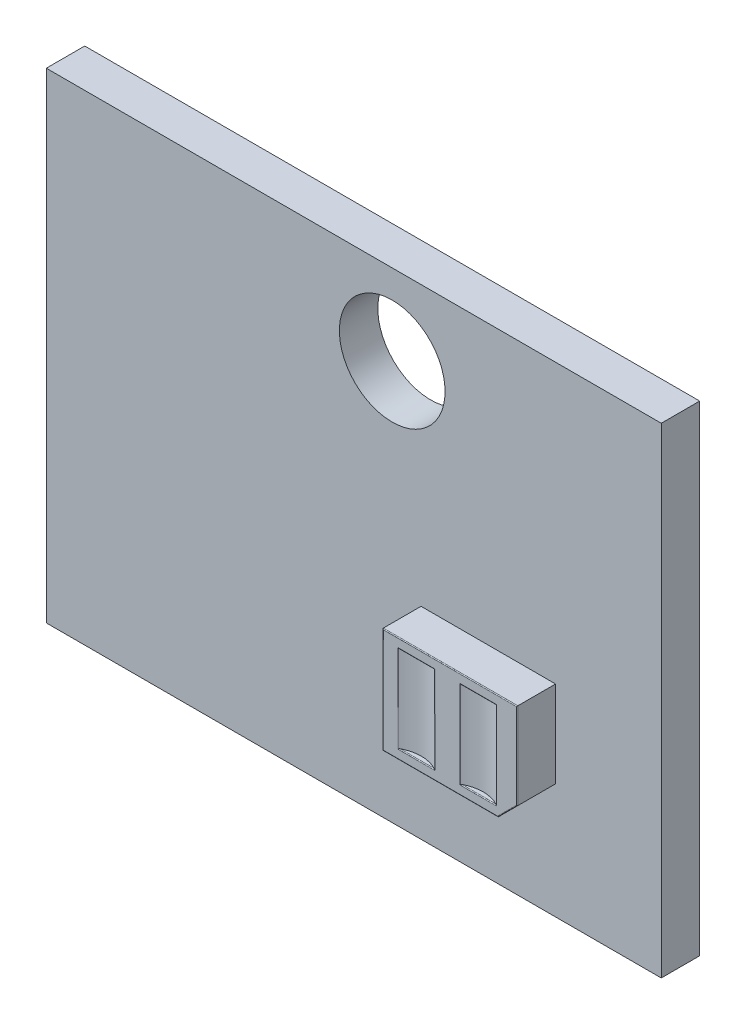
ISO-10303-21;
HEADER;
FILE_DESCRIPTION(('STEP AP214'),'2;1');
FILE_NAME('part.step','',(''),(''),'','','');
FILE_SCHEMA(('AUTOMOTIVE_DESIGN { 1 0 10303 214 1 1 1 1 }'));
ENDSEC;
DATA;
#1=APPLICATION_CONTEXT('core data for automotive mechanical design processes');
#2=APPLICATION_PROTOCOL_DEFINITION('international standard','automotive_design',2000,#1);
#3=PRODUCT_CONTEXT('',#1,'mechanical');
#4=PRODUCT('Part','Part','',(#3));
#5=PRODUCT_RELATED_PRODUCT_CATEGORY('part','',(#4));
#6=PRODUCT_DEFINITION_FORMATION('','',#4);
#7=PRODUCT_DEFINITION_CONTEXT('part definition',#1,'design');
#8=PRODUCT_DEFINITION('design','',#6,#7);
#9=PRODUCT_DEFINITION_SHAPE('','',#8);
#10=(LENGTH_UNIT() NAMED_UNIT(*) SI_UNIT(.MILLI.,.METRE.));
#11=(NAMED_UNIT(*) PLANE_ANGLE_UNIT() SI_UNIT($,.RADIAN.));
#12=(NAMED_UNIT(*) SI_UNIT($,.STERADIAN.) SOLID_ANGLE_UNIT());
#13=UNCERTAINTY_MEASURE_WITH_UNIT(LENGTH_MEASURE(1.E-05),#10,'distance_accuracy_value','');
#14=(GEOMETRIC_REPRESENTATION_CONTEXT(3) GLOBAL_UNCERTAINTY_ASSIGNED_CONTEXT((#13)) GLOBAL_UNIT_ASSIGNED_CONTEXT((#10,
#11,#12)) REPRESENTATION_CONTEXT('',''));
#15=CARTESIAN_POINT('',(0.,0.,0.));
#16=DIRECTION('',(0.,0.,1.));
#17=DIRECTION('',(1.,0.,0.));
#18=AXIS2_PLACEMENT_3D('',#15,#16,#17);
#19=CARTESIAN_POINT('',(1.5,-1.,2.));
#20=DIRECTION('',(0.,0.,-1.));
#21=DIRECTION('',(-1.,0.,0.));
#22=AXIS2_PLACEMENT_3D('',#19,#20,#21);
#23=PLANE('',#22);
#24=DIRECTION('',(-1.,0.,0.));
#25=VECTOR('',#24,1.);
#26=CARTESIAN_POINT('',(1.5,-3.52,2.));
#27=LINE('',#26,#25);
#28=CARTESIAN_POINT('',(2.86098672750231,-3.52,2.));
#29=VERTEX_POINT('',#28);
#30=CARTESIAN_POINT('',(1.90014058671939,-3.52,2.));
#31=VERTEX_POINT('',#30);
#32=EDGE_CURVE('E292',#29,#31,#27,.T.);
#33=ORIENTED_EDGE('',*,*,#32,.T.);
#34=DIRECTION('',(0.,-1.,0.));
#35=VECTOR('',#34,1.);
#36=CARTESIAN_POINT('',(1.90014058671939,-1.,2.));
#37=LINE('',#36,#35);
#38=CARTESIAN_POINT('',(1.90014058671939,-1.23,2.));
#39=VERTEX_POINT('',#38);
#40=EDGE_CURVE('E294',#31,#39,#37,.F.);
#41=ORIENTED_EDGE('',*,*,#40,.T.);
#42=DIRECTION('',(-1.,0.,0.));
#43=VECTOR('',#42,1.);
#44=CARTESIAN_POINT('',(2.85566536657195,-1.23,2.));
#45=LINE('',#44,#43);
#46=CARTESIAN_POINT('',(2.86098672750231,-1.23,2.));
#47=VERTEX_POINT('',#46);
#48=EDGE_CURVE('E288',#39,#47,#45,.F.);
#49=ORIENTED_EDGE('',*,*,#48,.T.);
#50=DIRECTION('',(0.,-1.,0.));
#51=VECTOR('',#50,1.);
#52=CARTESIAN_POINT('',(2.86098672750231,-1.,2.));
#53=LINE('',#52,#51);
#54=EDGE_CURVE('E290',#47,#29,#53,.T.);
#55=ORIENTED_EDGE('',*,*,#54,.T.);
#56=EDGE_LOOP('',(#33,#41,#49,#55));
#57=FACE_BOUND('',#56,.T.);
#58=DIRECTION('',(0.,1.,0.));
#59=VECTOR('',#58,1.);
#60=CARTESIAN_POINT('',(4.98,-1.,2.));
#61=LINE('',#60,#59);
#62=CARTESIAN_POINT('',(4.98,-3.24171572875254,2.));
#63=VERTEX_POINT('',#62);
#64=CARTESIAN_POINT('',(4.98,-1.02,2.));
#65=VERTEX_POINT('',#64);
#66=EDGE_CURVE('E283',#63,#65,#61,.T.);
#67=ORIENTED_EDGE('',*,*,#66,.T.);
#68=DIRECTION('',(-1.,0.,0.));
#69=VECTOR('',#68,1.);
#70=CARTESIAN_POINT('',(1.5,-1.02,2.));
#71=LINE('',#70,#69);
#72=CARTESIAN_POINT('',(1.52,-1.02,2.));
#73=VERTEX_POINT('',#72);
#74=EDGE_CURVE('E285',#65,#73,#71,.T.);
#75=ORIENTED_EDGE('',*,*,#74,.T.);
#76=DIRECTION('',(0.,-1.,0.));
#77=VECTOR('',#76,1.);
#78=CARTESIAN_POINT('',(1.52,-1.,2.));
#79=LINE('',#78,#77);
#80=CARTESIAN_POINT('',(1.52,-3.73,2.));
#81=VERTEX_POINT('',#80);
#82=EDGE_CURVE('E277',#73,#81,#79,.T.);
#83=ORIENTED_EDGE('',*,*,#82,.T.);
#84=DIRECTION('',(1.,0.,0.));
#85=VECTOR('',#84,1.);
#86=CARTESIAN_POINT('',(1.5,-3.73,2.));
#87=LINE('',#86,#85);
#88=CARTESIAN_POINT('',(4.49171572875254,-3.73,2.));
#89=VERTEX_POINT('',#88);
#90=EDGE_CURVE('E279',#81,#89,#87,.T.);
#91=ORIENTED_EDGE('',*,*,#90,.T.);
#92=DIRECTION('',(0.707106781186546,0.707106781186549,0.));
#93=VECTOR('',#92,1.);
#94=CARTESIAN_POINT('',(4.36085786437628,-3.86085786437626,2.));
#95=LINE('',#94,#93);
#96=EDGE_CURVE('E281',#89,#63,#95,.T.);
#97=ORIENTED_EDGE('',*,*,#96,.T.);
#98=EDGE_LOOP('',(#67,#75,#83,#91,#97));
#99=FACE_BOUND('',#98,.T.);
#100=DIRECTION('',(0.,-1.,0.));
#101=VECTOR('',#100,1.);
#102=CARTESIAN_POINT('',(4.46908404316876,-1.,2.));
#103=LINE('',#102,#101);
#104=CARTESIAN_POINT('',(4.46908404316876,-1.23,2.));
#105=VERTEX_POINT('',#104);
#106=CARTESIAN_POINT('',(4.46908404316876,-3.52,2.));
#107=VERTEX_POINT('',#106);
#108=EDGE_CURVE('E272',#105,#107,#103,.T.);
#109=ORIENTED_EDGE('',*,*,#108,.T.);
#110=DIRECTION('',(-1.,0.,0.));
#111=VECTOR('',#110,1.);
#112=CARTESIAN_POINT('',(3.51355926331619,-3.52,2.));
#113=LINE('',#112,#111);
#114=CARTESIAN_POINT('',(3.50823790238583,-3.52,2.));
#115=VERTEX_POINT('',#114);
#116=EDGE_CURVE('E274',#107,#115,#113,.T.);
#117=ORIENTED_EDGE('',*,*,#116,.T.);
#118=DIRECTION('',(0.,-1.,0.));
#119=VECTOR('',#118,1.);
#120=CARTESIAN_POINT('',(3.50823790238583,-1.,2.));
#121=LINE('',#120,#119);
#122=CARTESIAN_POINT('',(3.50823790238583,-1.23,2.));
#123=VERTEX_POINT('',#122);
#124=EDGE_CURVE('E268',#115,#123,#121,.F.);
#125=ORIENTED_EDGE('',*,*,#124,.T.);
#126=DIRECTION('',(-1.,0.,0.));
#127=VECTOR('',#126,1.);
#128=CARTESIAN_POINT('',(1.5,-1.23,2.));
#129=LINE('',#128,#127);
#130=EDGE_CURVE('E270',#123,#105,#129,.F.);
#131=ORIENTED_EDGE('',*,*,#130,.T.);
#132=EDGE_LOOP('',(#109,#117,#125,#131));
#133=FACE_BOUND('',#132,.T.);
#134=ADVANCED_FACE('F31',(#57,#99,#133),#23,.F.);
#135=CARTESIAN_POINT('',(-8.25,-6.25,1.));
#136=DIRECTION('',(0.,0.,1.));
#137=DIRECTION('',(1.,0.,0.));
#138=AXIS2_PLACEMENT_3D('',#135,#136,#137);
#139=PLANE('',#138);
#140=CARTESIAN_POINT('',(0.75,4.15,1.));
#141=DIRECTION('',(0.,0.,1.));
#142=DIRECTION('',(1.,0.,0.));
#143=AXIS2_PLACEMENT_3D('',#140,#141,#142);
#144=CIRCLE('',#143,1.375);
#145=CARTESIAN_POINT('',(2.125,4.15,1.));
#146=VERTEX_POINT('',#145);
#147=EDGE_CURVE('E226',#146,#146,#144,.T.);
#148=ORIENTED_EDGE('',*,*,#147,.F.);
#149=EDGE_LOOP('',(#148));
#150=FACE_BOUND('',#149,.T.);
#151=DIRECTION('',(0.,-1.,0.));
#152=VECTOR('',#151,1.);
#153=CARTESIAN_POINT('',(-8.25,6.25,1.));
#154=LINE('',#153,#152);
#155=CARTESIAN_POINT('',(-8.25,6.25,1.));
#156=VERTEX_POINT('',#155);
#157=CARTESIAN_POINT('',(-8.25,-6.25,1.));
#158=VERTEX_POINT('',#157);
#159=EDGE_CURVE('E243',#156,#158,#154,.T.);
#160=ORIENTED_EDGE('',*,*,#159,.T.);
#161=DIRECTION('',(1.,0.,0.));
#162=VECTOR('',#161,1.);
#163=CARTESIAN_POINT('',(-8.25,-6.25,1.));
#164=LINE('',#163,#162);
#165=CARTESIAN_POINT('',(7.75,-6.25,1.));
#166=VERTEX_POINT('',#165);
#167=EDGE_CURVE('E246',#158,#166,#164,.T.);
#168=ORIENTED_EDGE('',*,*,#167,.T.);
#169=DIRECTION('',(0.,1.,0.));
#170=VECTOR('',#169,1.);
#171=CARTESIAN_POINT('',(7.75,6.25,1.));
#172=LINE('',#171,#170);
#173=CARTESIAN_POINT('',(7.75,6.25,1.));
#174=VERTEX_POINT('',#173);
#175=EDGE_CURVE('E248',#166,#174,#172,.T.);
#176=ORIENTED_EDGE('',*,*,#175,.T.);
#177=DIRECTION('',(-1.,0.,0.));
#178=VECTOR('',#177,1.);
#179=CARTESIAN_POINT('',(-8.25,6.25,1.));
#180=LINE('',#179,#178);
#181=EDGE_CURVE('E250',#174,#156,#180,.T.);
#182=ORIENTED_EDGE('',*,*,#181,.T.);
#183=EDGE_LOOP('',(#160,#168,#176,#182));
#184=FACE_BOUND('',#183,.T.);
#185=DIRECTION('',(-1.,0.,0.));
#186=VECTOR('',#185,1.);
#187=CARTESIAN_POINT('',(-8.25,-3.75,1.));
#188=LINE('',#187,#186);
#189=CARTESIAN_POINT('',(4.5,-3.75,1.));
#190=VERTEX_POINT('',#189);
#191=CARTESIAN_POINT('',(1.5,-3.75,1.));
#192=VERTEX_POINT('',#191);
#193=EDGE_CURVE('E222',#190,#192,#188,.T.);
#194=ORIENTED_EDGE('',*,*,#193,.T.);
#195=DIRECTION('',(0.,1.,0.));
#196=VECTOR('',#195,1.);
#197=CARTESIAN_POINT('',(1.5,-6.25,1.));
#198=LINE('',#197,#196);
#199=CARTESIAN_POINT('',(1.5,-1.,1.));
#200=VERTEX_POINT('',#199);
#201=EDGE_CURVE('E199',#192,#200,#198,.T.);
#202=ORIENTED_EDGE('',*,*,#201,.T.);
#203=DIRECTION('',(1.,0.,0.));
#204=VECTOR('',#203,1.);
#205=CARTESIAN_POINT('',(-8.25,-1.,1.));
#206=LINE('',#205,#204);
#207=CARTESIAN_POINT('',(5.,-1.,1.));
#208=VERTEX_POINT('',#207);
#209=EDGE_CURVE('E210',#200,#208,#206,.T.);
#210=ORIENTED_EDGE('',*,*,#209,.T.);
#211=DIRECTION('',(0.,-1.,0.));
#212=VECTOR('',#211,1.);
#213=CARTESIAN_POINT('',(5.,-6.25,1.));
#214=LINE('',#213,#212);
#215=CARTESIAN_POINT('',(5.,-3.25,1.));
#216=VERTEX_POINT('',#215);
#217=EDGE_CURVE('E216',#208,#216,#214,.T.);
#218=ORIENTED_EDGE('',*,*,#217,.T.);
#219=DIRECTION('',(-0.707106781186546,-0.707106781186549,0.));
#220=VECTOR('',#219,1.);
#221=CARTESIAN_POINT('',(-3.12499999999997,-11.375,1.));
#222=LINE('',#221,#220);
#223=EDGE_CURVE('E228',#216,#190,#222,.T.);
#224=ORIENTED_EDGE('',*,*,#223,.T.);
#225=EDGE_LOOP('',(#194,#202,#210,#218,#224));
#226=FACE_BOUND('',#225,.T.);
#227=ADVANCED_FACE('F219',(#150,#184,#226),#139,.T.);
#228=CARTESIAN_POINT('',(-8.25,-6.25,0.));
#229=DIRECTION('',(0.,0.,1.));
#230=DIRECTION('',(1.,0.,0.));
#231=AXIS2_PLACEMENT_3D('',#228,#229,#230);
#232=PLANE('',#231);
#233=CARTESIAN_POINT('',(0.75,4.15,0.));
#234=DIRECTION('',(0.,0.,1.));
#235=DIRECTION('',(1.,0.,0.));
#236=AXIS2_PLACEMENT_3D('',#233,#234,#235);
#237=CIRCLE('',#236,1.375);
#238=CARTESIAN_POINT('',(2.125,4.15,0.));
#239=VERTEX_POINT('',#238);
#240=EDGE_CURVE('E223',#239,#239,#237,.T.);
#241=ORIENTED_EDGE('',*,*,#240,.T.);
#242=EDGE_LOOP('',(#241));
#243=FACE_BOUND('',#242,.T.);
#244=DIRECTION('',(0.,-1.,0.));
#245=VECTOR('',#244,1.);
#246=CARTESIAN_POINT('',(-8.25,6.25,0.));
#247=LINE('',#246,#245);
#248=CARTESIAN_POINT('',(-8.25,6.25,0.));
#249=VERTEX_POINT('',#248);
#250=CARTESIAN_POINT('',(-8.25,-6.25,0.));
#251=VERTEX_POINT('',#250);
#252=EDGE_CURVE('E234',#249,#251,#247,.T.);
#253=ORIENTED_EDGE('',*,*,#252,.F.);
#254=DIRECTION('',(-1.,0.,0.));
#255=VECTOR('',#254,1.);
#256=CARTESIAN_POINT('',(-8.25,6.25,0.));
#257=LINE('',#256,#255);
#258=CARTESIAN_POINT('',(7.75,6.25,0.));
#259=VERTEX_POINT('',#258);
#260=EDGE_CURVE('E241',#259,#249,#257,.T.);
#261=ORIENTED_EDGE('',*,*,#260,.F.);
#262=DIRECTION('',(0.,1.,0.));
#263=VECTOR('',#262,1.);
#264=CARTESIAN_POINT('',(7.75,6.25,0.));
#265=LINE('',#264,#263);
#266=CARTESIAN_POINT('',(7.75,-6.25,0.));
#267=VERTEX_POINT('',#266);
#268=EDGE_CURVE('E239',#267,#259,#265,.T.);
#269=ORIENTED_EDGE('',*,*,#268,.F.);
#270=DIRECTION('',(1.,0.,0.));
#271=VECTOR('',#270,1.);
#272=CARTESIAN_POINT('',(-8.25,-6.25,0.));
#273=LINE('',#272,#271);
#274=EDGE_CURVE('E237',#251,#267,#273,.T.);
#275=ORIENTED_EDGE('',*,*,#274,.F.);
#276=EDGE_LOOP('',(#253,#261,#269,#275));
#277=FACE_BOUND('',#276,.T.);
#278=ADVANCED_FACE('F699',(#243,#277),#232,.F.);
#279=CARTESIAN_POINT('',(-8.25,6.25,1.));
#280=DIRECTION('',(1.,0.,0.));
#281=DIRECTION('',(0.,0.,-1.));
#282=AXIS2_PLACEMENT_3D('',#279,#280,#281);
#283=PLANE('',#282);
#284=ORIENTED_EDGE('',*,*,#252,.T.);
#285=DIRECTION('',(0.,0.,-1.));
#286=VECTOR('',#285,1.);
#287=CARTESIAN_POINT('',(-8.25,-6.25,1.));
#288=LINE('',#287,#286);
#289=EDGE_CURVE('E261',#158,#251,#288,.T.);
#290=ORIENTED_EDGE('',*,*,#289,.F.);
#291=ORIENTED_EDGE('',*,*,#159,.F.);
#292=DIRECTION('',(0.,0.,-1.));
#293=VECTOR('',#292,1.);
#294=CARTESIAN_POINT('',(-8.25,6.25,1.));
#295=LINE('',#294,#293);
#296=EDGE_CURVE('E252',#156,#249,#295,.T.);
#297=ORIENTED_EDGE('',*,*,#296,.T.);
#298=EDGE_LOOP('',(#284,#290,#291,#297));
#299=FACE_BOUND('',#298,.T.);
#300=ADVANCED_FACE('F33',(#299),#283,.F.);
#301=CARTESIAN_POINT('',(-8.25,-6.25,1.));
#302=DIRECTION('',(0.,1.,0.));
#303=DIRECTION('',(0.,0.,1.));
#304=AXIS2_PLACEMENT_3D('',#301,#302,#303);
#305=PLANE('',#304);
#306=ORIENTED_EDGE('',*,*,#274,.T.);
#307=DIRECTION('',(0.,0.,-1.));
#308=VECTOR('',#307,1.);
#309=CARTESIAN_POINT('',(7.75,-6.25,1.));
#310=LINE('',#309,#308);
#311=EDGE_CURVE('E258',#166,#267,#310,.T.);
#312=ORIENTED_EDGE('',*,*,#311,.F.);
#313=ORIENTED_EDGE('',*,*,#167,.F.);
#314=ORIENTED_EDGE('',*,*,#289,.T.);
#315=EDGE_LOOP('',(#306,#312,#313,#314));
#316=FACE_BOUND('',#315,.T.);
#317=ADVANCED_FACE('F726',(#316),#305,.F.);
#318=CARTESIAN_POINT('',(7.75,6.25,1.));
#319=DIRECTION('',(-1.,0.,0.));
#320=DIRECTION('',(0.,0.,1.));
#321=AXIS2_PLACEMENT_3D('',#318,#319,#320);
#322=PLANE('',#321);
#323=ORIENTED_EDGE('',*,*,#268,.T.);
#324=DIRECTION('',(0.,0.,-1.));
#325=VECTOR('',#324,1.);
#326=CARTESIAN_POINT('',(7.75,6.25,1.));
#327=LINE('',#326,#325);
#328=EDGE_CURVE('E255',#174,#259,#327,.T.);
#329=ORIENTED_EDGE('',*,*,#328,.F.);
#330=ORIENTED_EDGE('',*,*,#175,.F.);
#331=ORIENTED_EDGE('',*,*,#311,.T.);
#332=EDGE_LOOP('',(#323,#329,#330,#331));
#333=FACE_BOUND('',#332,.T.);
#334=ADVANCED_FACE('F717',(#333),#322,.F.);
#335=CARTESIAN_POINT('',(-8.25,6.25,1.));
#336=DIRECTION('',(0.,-1.,0.));
#337=DIRECTION('',(0.,0.,-1.));
#338=AXIS2_PLACEMENT_3D('',#335,#336,#337);
#339=PLANE('',#338);
#340=ORIENTED_EDGE('',*,*,#260,.T.);
#341=ORIENTED_EDGE('',*,*,#296,.F.);
#342=ORIENTED_EDGE('',*,*,#181,.F.);
#343=ORIENTED_EDGE('',*,*,#328,.T.);
#344=EDGE_LOOP('',(#340,#341,#342,#343));
#345=FACE_BOUND('',#344,.T.);
#346=ADVANCED_FACE('F708',(#345),#339,.F.);
#347=CARTESIAN_POINT('',(0.75,4.15,1.));
#348=DIRECTION('',(0.,0.,-1.));
#349=DIRECTION('',(-1.,0.,0.));
#350=AXIS2_PLACEMENT_3D('',#347,#348,#349);
#351=CYLINDRICAL_SURFACE('',#350,1.375);
#352=ORIENTED_EDGE('',*,*,#147,.T.);
#353=EDGE_LOOP('',(#352));
#354=FACE_BOUND('',#353,.T.);
#355=ORIENTED_EDGE('',*,*,#240,.F.);
#356=EDGE_LOOP('',(#355));
#357=FACE_BOUND('',#356,.T.);
#358=ADVANCED_FACE('F691',(#354,#357),#351,.F.);
#359=CARTESIAN_POINT('',(1.5,-3.75,2.));
#360=DIRECTION('',(1.,0.,0.));
#361=DIRECTION('',(0.,1.,0.));
#362=AXIS2_PLACEMENT_3D('',#359,#360,#361);
#363=PLANE('',#362);
#364=DIRECTION('',(0.,0.,-1.));
#365=VECTOR('',#364,1.);
#366=CARTESIAN_POINT('',(1.5,-3.75,2.));
#367=LINE('',#366,#365);
#368=CARTESIAN_POINT('',(1.5,-3.75,1.98));
#369=VERTEX_POINT('',#368);
#370=EDGE_CURVE('E217',#369,#192,#367,.T.);
#371=ORIENTED_EDGE('',*,*,#370,.F.);
#372=DIRECTION('',(0.,-1.,0.));
#373=VECTOR('',#372,1.);
#374=CARTESIAN_POINT('',(1.5,-3.75,1.98));
#375=LINE('',#374,#373);
#376=CARTESIAN_POINT('',(1.5,-1.,1.98));
#377=VERTEX_POINT('',#376);
#378=EDGE_CURVE('E202',#369,#377,#375,.F.);
#379=ORIENTED_EDGE('',*,*,#378,.T.);
#380=DIRECTION('',(0.,0.,-1.));
#381=VECTOR('',#380,1.);
#382=CARTESIAN_POINT('',(1.5,-1.,2.));
#383=LINE('',#382,#381);
#384=EDGE_CURVE('E194',#377,#200,#383,.T.);
#385=ORIENTED_EDGE('',*,*,#384,.T.);
#386=ORIENTED_EDGE('',*,*,#201,.F.);
#387=EDGE_LOOP('',(#371,#379,#385,#386));
#388=FACE_BOUND('',#387,.T.);
#389=ADVANCED_FACE('F197',(#388),#363,.F.);
#390=CARTESIAN_POINT('',(4.5,-3.75,2.));
#391=DIRECTION('',(0.,1.,0.));
#392=DIRECTION('',(-1.,0.,0.));
#393=AXIS2_PLACEMENT_3D('',#390,#391,#392);
#394=PLANE('',#393);
#395=DIRECTION('',(0.,0.,-1.));
#396=VECTOR('',#395,1.);
#397=CARTESIAN_POINT('',(4.5,-3.75,2.));
#398=LINE('',#397,#396);
#399=CARTESIAN_POINT('',(4.5,-3.75,1.98));
#400=VERTEX_POINT('',#399);
#401=EDGE_CURVE('E454',#400,#190,#398,.T.);
#402=ORIENTED_EDGE('',*,*,#401,.F.);
#403=DIRECTION('',(1.,0.,0.));
#404=VECTOR('',#403,1.);
#405=CARTESIAN_POINT('',(4.5,-3.75,1.98));
#406=LINE('',#405,#404);
#407=EDGE_CURVE('E307',#400,#369,#406,.F.);
#408=ORIENTED_EDGE('',*,*,#407,.T.);
#409=ORIENTED_EDGE('',*,*,#370,.T.);
#410=ORIENTED_EDGE('',*,*,#193,.F.);
#411=EDGE_LOOP('',(#402,#408,#409,#410));
#412=FACE_BOUND('',#411,.T.);
#413=ADVANCED_FACE('F465',(#412),#394,.F.);
#414=CARTESIAN_POINT('',(5.,-3.25,2.));
#415=DIRECTION('',(-0.707106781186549,0.707106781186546,0.));
#416=DIRECTION('',(-0.707106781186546,-0.707106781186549,0.));
#417=AXIS2_PLACEMENT_3D('',#414,#415,#416);
#418=PLANE('',#417);
#419=DIRECTION('',(0.,0.,-1.));
#420=VECTOR('',#419,1.);
#421=CARTESIAN_POINT('',(5.,-3.25,2.));
#422=LINE('',#421,#420);
#423=CARTESIAN_POINT('',(5.,-3.25,1.98));
#424=VERTEX_POINT('',#423);
#425=EDGE_CURVE('E452',#424,#216,#422,.T.);
#426=ORIENTED_EDGE('',*,*,#425,.F.);
#427=DIRECTION('',(0.707106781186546,0.707106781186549,0.));
#428=VECTOR('',#427,1.);
#429=CARTESIAN_POINT('',(5.,-3.25,1.98));
#430=LINE('',#429,#428);
#431=EDGE_CURVE('E305',#424,#400,#430,.F.);
#432=ORIENTED_EDGE('',*,*,#431,.T.);
#433=ORIENTED_EDGE('',*,*,#401,.T.);
#434=ORIENTED_EDGE('',*,*,#223,.F.);
#435=EDGE_LOOP('',(#426,#432,#433,#434));
#436=FACE_BOUND('',#435,.T.);
#437=ADVANCED_FACE('F460',(#436),#418,.F.);
#438=CARTESIAN_POINT('',(5.,-1.,2.));
#439=DIRECTION('',(-1.,0.,0.));
#440=DIRECTION('',(0.,0.,1.));
#441=AXIS2_PLACEMENT_3D('',#438,#439,#440);
#442=PLANE('',#441);
#443=DIRECTION('',(0.,0.,-1.));
#444=VECTOR('',#443,1.);
#445=CARTESIAN_POINT('',(5.,-1.,2.));
#446=LINE('',#445,#444);
#447=CARTESIAN_POINT('',(5.,-1.,1.98));
#448=VERTEX_POINT('',#447);
#449=EDGE_CURVE('E206',#448,#208,#446,.T.);
#450=ORIENTED_EDGE('',*,*,#449,.F.);
#451=DIRECTION('',(0.,1.,0.));
#452=VECTOR('',#451,1.);
#453=CARTESIAN_POINT('',(5.,-1.,1.98));
#454=LINE('',#453,#452);
#455=EDGE_CURVE('E303',#448,#424,#454,.F.);
#456=ORIENTED_EDGE('',*,*,#455,.T.);
#457=ORIENTED_EDGE('',*,*,#425,.T.);
#458=ORIENTED_EDGE('',*,*,#217,.F.);
#459=EDGE_LOOP('',(#450,#456,#457,#458));
#460=FACE_BOUND('',#459,.T.);
#461=ADVANCED_FACE('F480',(#460),#442,.F.);
#462=CARTESIAN_POINT('',(1.5,-1.,2.));
#463=DIRECTION('',(0.,-1.,0.));
#464=DIRECTION('',(0.,0.,-1.));
#465=AXIS2_PLACEMENT_3D('',#462,#463,#464);
#466=PLANE('',#465);
#467=ORIENTED_EDGE('',*,*,#384,.F.);
#468=DIRECTION('',(-1.,0.,0.));
#469=VECTOR('',#468,1.);
#470=CARTESIAN_POINT('',(1.5,-1.,1.98));
#471=LINE('',#470,#469);
#472=EDGE_CURVE('E301',#377,#448,#471,.F.);
#473=ORIENTED_EDGE('',*,*,#472,.T.);
#474=ORIENTED_EDGE('',*,*,#449,.T.);
#475=ORIENTED_EDGE('',*,*,#209,.F.);
#476=EDGE_LOOP('',(#467,#473,#474,#475));
#477=FACE_BOUND('',#476,.T.);
#478=ADVANCED_FACE('F211',(#477),#466,.F.);
#479=CARTESIAN_POINT('',(2.38056365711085,-1.25,2.82428912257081));
#480=DIRECTION('',(0.,-1.,0.));
#481=DIRECTION('',(0.,0.,-1.));
#482=AXIS2_PLACEMENT_3D('',#479,#480,#481);
#483=CYLINDRICAL_SURFACE('',#482,0.95140642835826);
#484=CARTESIAN_POINT('',(2.38056365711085,-1.25,2.82428912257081));
#485=DIRECTION('',(0.,-1.,0.));
#486=DIRECTION('',(0.,0.,-1.));
#487=AXIS2_PLACEMENT_3D('',#484,#485,#486);
#488=CIRCLE('',#487,0.95140642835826);
#489=CARTESIAN_POINT('',(1.94198633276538,-1.25,1.98));
#490=VERTEX_POINT('',#489);
#491=CARTESIAN_POINT('',(2.81914098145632,-1.25,1.98));
#492=VERTEX_POINT('',#491);
#493=EDGE_CURVE('E207',#490,#492,#488,.T.);
#494=ORIENTED_EDGE('',*,*,#493,.F.);
#495=CARTESIAN_POINT('',(1.94198633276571,-1.25,1.97999999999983));
#496=CARTESIAN_POINT('',(1.93993675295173,-1.24999878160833,1.98106471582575));
#497=CARTESIAN_POINT('',(1.93789335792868,-1.24991539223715,1.98213566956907));
#498=CARTESIAN_POINT('',(1.93381444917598,-1.24956475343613,1.98429225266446));
#499=CARTESIAN_POINT('',(1.93177905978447,-1.24929638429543,1.98537793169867));
#500=CARTESIAN_POINT('',(1.92590873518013,-1.24822088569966,1.98853680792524));
#501=CARTESIAN_POINT('',(1.92211139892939,-1.24714600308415,1.9906149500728));
#502=CARTESIAN_POINT('',(1.91699554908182,-1.2448349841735,1.99345711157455));
#503=CARTESIAN_POINT('',(1.9155145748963,-1.24405237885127,1.99428546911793));
#504=CARTESIAN_POINT('',(1.9126624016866,-1.24220501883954,1.99588979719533));
#505=CARTESIAN_POINT('',(1.91129386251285,-1.24113512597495,1.99666445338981));
#506=CARTESIAN_POINT('',(1.91003187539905,-1.23989128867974,1.9973828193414));
#507=B_SPLINE_CURVE_WITH_KNOTS('',3,(#495,#496,#497,#498,#499,#500,#501,#502,#503,#504,#505,
#506),.UNSPECIFIED.,.F.,.F.,(4,2,2,2,2,4),(0.,0.00692143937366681,0.0138851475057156,
0.0271478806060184,0.0327331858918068,0.0384259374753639),.UNSPECIFIED.);
#508=CARTESIAN_POINT('',(1.9100318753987,-1.23989128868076,1.9973828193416));
#509=VERTEX_POINT('',#508);
#510=EDGE_CURVE('E350',#490,#509,#507,.T.);
#511=ORIENTED_EDGE('',*,*,#510,.T.);
#512=DIRECTION('',(0.,-1.,0.));
#513=VECTOR('',#512,1.);
#514=CARTESIAN_POINT('',(1.9100318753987,-1.25,1.9973828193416));
#515=LINE('',#514,#513);
#516=CARTESIAN_POINT('',(1.9100318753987,-3.51010871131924,1.9973828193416));
#517=VERTEX_POINT('',#516);
#518=EDGE_CURVE('E266',#509,#517,#515,.T.);
#519=ORIENTED_EDGE('',*,*,#518,.T.);
#520=CARTESIAN_POINT('',(1.9100318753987,-3.51010871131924,1.9973828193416));
#521=CARTESIAN_POINT('',(1.9111636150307,-3.5089899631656,1.99673862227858));
#522=CARTESIAN_POINT('',(1.91238480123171,-3.50801246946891,1.99604700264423));
#523=CARTESIAN_POINT('',(1.91493648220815,-3.50629412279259,1.99460993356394));
#524=CARTESIAN_POINT('',(1.91626577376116,-3.50555102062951,1.99386508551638));
#525=CARTESIAN_POINT('',(1.92017488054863,-3.50366257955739,1.99168783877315));
#526=CARTESIAN_POINT('',(1.92283524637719,-3.50273080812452,1.99022177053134));
#527=CARTESIAN_POINT('',(1.92827461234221,-3.50129136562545,1.98725952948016));
#528=CARTESIAN_POINT('',(1.93105444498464,-3.50078746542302,1.98576320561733));
#529=CARTESIAN_POINT('',(1.93521028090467,-3.50030448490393,1.98355318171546));
#530=CARTESIAN_POINT('',(1.93656944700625,-3.50018876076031,1.98283460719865));
#531=CARTESIAN_POINT('',(1.93928062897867,-3.50003704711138,1.98140965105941));
#532=CARTESIAN_POINT('',(1.94063257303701,-3.50000024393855,1.9807032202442));
#533=CARTESIAN_POINT('',(1.94198633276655,-3.5,1.9799999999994));
#534=B_SPLINE_CURVE_WITH_KNOTS('',3,(#520,#521,#522,#523,#524,#525,#526,#527,#528,#529,#530,
#531,#532,#533),.UNSPECIFIED.,.F.,.F.,(4,2,2,2,2,2,4),(0.,0.00511946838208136,
0.0101882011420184,0.0196727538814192,0.0292400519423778,0.03386367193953,0.0384393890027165),.UNSPECIFIED.);
#535=CARTESIAN_POINT('',(1.94198633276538,-3.5,1.98));
#536=VERTEX_POINT('',#535);
#537=EDGE_CURVE('E317',#517,#536,#534,.T.);
#538=ORIENTED_EDGE('',*,*,#537,.T.);
#539=CARTESIAN_POINT('',(2.38056365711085,-3.5,2.82428912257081));
#540=DIRECTION('',(0.,-1.,0.));
#541=DIRECTION('',(0.,0.,-1.));
#542=AXIS2_PLACEMENT_3D('',#539,#540,#541);
#543=CIRCLE('',#542,0.95140642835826);
#544=CARTESIAN_POINT('',(2.81914098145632,-3.5,1.98));
#545=VERTEX_POINT('',#544);
#546=EDGE_CURVE('E446',#536,#545,#543,.T.);
#547=ORIENTED_EDGE('',*,*,#546,.T.);
#548=CARTESIAN_POINT('',(2.81914098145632,-3.5,1.98));
#549=CARTESIAN_POINT('',(2.82119056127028,-3.50000121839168,1.98106471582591));
#550=CARTESIAN_POINT('',(2.82323395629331,-3.50008460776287,1.98213566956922));
#551=CARTESIAN_POINT('',(2.82731286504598,-3.5004352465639,1.9842922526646));
#552=CARTESIAN_POINT('',(2.82934825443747,-3.50070361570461,1.98537793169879));
#553=CARTESIAN_POINT('',(2.83521857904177,-3.5017791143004,1.98853680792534));
#554=CARTESIAN_POINT('',(2.83901591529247,-3.50285399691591,1.99061495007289));
#555=CARTESIAN_POINT('',(2.84413176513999,-3.50516501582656,1.99345711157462));
#556=CARTESIAN_POINT('',(2.84561273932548,-3.50594762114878,1.99428546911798));
#557=CARTESIAN_POINT('',(2.84846491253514,-3.50779498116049,1.99588979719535));
#558=CARTESIAN_POINT('',(2.84983345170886,-3.50886487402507,1.99666445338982));
#559=CARTESIAN_POINT('',(2.85109543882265,-3.51010871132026,1.9973828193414));
#560=B_SPLINE_CURVE_WITH_KNOTS('',3,(#548,#549,#550,#551,#552,#553,#554,#555,#556,#557,#558,
#559),.UNSPECIFIED.,.F.,.F.,(4,2,2,2,2,4),(0.,0.00692143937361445,0.0138851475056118,
0.0271478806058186,0.0327331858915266,0.0384259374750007),.UNSPECIFIED.);
#561=CARTESIAN_POINT('',(2.851095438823,-3.51010871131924,1.9973828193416));
#562=VERTEX_POINT('',#561);
#563=EDGE_CURVE('E324',#545,#562,#560,.T.);
#564=ORIENTED_EDGE('',*,*,#563,.T.);
#565=DIRECTION('',(0.,-1.,0.));
#566=VECTOR('',#565,1.);
#567=CARTESIAN_POINT('',(2.851095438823,-1.25,1.9973828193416));
#568=LINE('',#567,#566);
#569=CARTESIAN_POINT('',(2.851095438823,-1.23989128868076,1.9973828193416));
#570=VERTEX_POINT('',#569);
#571=EDGE_CURVE('E264',#562,#570,#568,.F.);
#572=ORIENTED_EDGE('',*,*,#571,.T.);
#573=CARTESIAN_POINT('',(2.851095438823,-1.23989128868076,1.9973828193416));
#574=CARTESIAN_POINT('',(2.849963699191,-1.24101003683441,1.99673862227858));
#575=CARTESIAN_POINT('',(2.84874251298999,-1.24198753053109,1.99604700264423));
#576=CARTESIAN_POINT('',(2.84619083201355,-1.24370587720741,1.99460993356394));
#577=CARTESIAN_POINT('',(2.84486154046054,-1.24444897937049,1.99386508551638));
#578=CARTESIAN_POINT('',(2.84095243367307,-1.24633742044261,1.99168783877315));
#579=CARTESIAN_POINT('',(2.8382920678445,-1.24726919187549,1.99022177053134));
#580=CARTESIAN_POINT('',(2.83285270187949,-1.24870863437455,1.98725952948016));
#581=CARTESIAN_POINT('',(2.83007286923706,-1.24921253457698,1.98576320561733));
#582=CARTESIAN_POINT('',(2.82591703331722,-1.24969551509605,1.98355318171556));
#583=CARTESIAN_POINT('',(2.82455786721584,-1.24981123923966,1.98283460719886));
#584=CARTESIAN_POINT('',(2.82184668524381,-1.24996295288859,1.98140965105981));
#585=CARTESIAN_POINT('',(2.82049474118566,-1.24999975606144,1.98070322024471));
#586=CARTESIAN_POINT('',(2.81914098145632,-1.25,1.98));
#587=B_SPLINE_CURVE_WITH_KNOTS('',3,(#573,#574,#575,#576,#577,#578,#579,#580,#581,#582,#583,
#584,#585,#586),.UNSPECIFIED.,.F.,.F.,(4,2,2,2,2,2,4),(0.,0.00511946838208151,
0.0101882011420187,0.0196727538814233,0.0292400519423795,0.0338636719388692,0.038439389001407),.UNSPECIFIED.);
#588=EDGE_CURVE('E355',#570,#492,#587,.T.);
#589=ORIENTED_EDGE('',*,*,#588,.T.);
#590=EDGE_LOOP('',(#494,#511,#519,#538,#547,#564,#572,#589));
#591=FACE_BOUND('',#590,.T.);
#592=ADVANCED_FACE('F329',(#591),#483,.F.);
#593=CARTESIAN_POINT('',(2.38056365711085,-1.25,2.82428912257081));
#594=DIRECTION('',(0.,-1.,0.));
#595=DIRECTION('',(0.,0.,-1.));
#596=AXIS2_PLACEMENT_3D('',#593,#594,#595);
#597=PLANE('',#596);
#598=ORIENTED_EDGE('',*,*,#493,.T.);
#599=DIRECTION('',(-1.,0.,0.));
#600=VECTOR('',#599,1.);
#601=CARTESIAN_POINT('',(1.90546194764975,-1.25,1.98));
#602=LINE('',#601,#600);
#603=EDGE_CURVE('E299',#492,#490,#602,.T.);
#604=ORIENTED_EDGE('',*,*,#603,.T.);
#605=EDGE_LOOP('',(#598,#604));
#606=FACE_BOUND('',#605,.T.);
#607=ADVANCED_FACE('F508',(#606),#597,.T.);
#608=CARTESIAN_POINT('',(2.38056365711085,-3.5,2.82428912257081));
#609=DIRECTION('',(0.,-1.,0.));
#610=DIRECTION('',(0.,0.,-1.));
#611=AXIS2_PLACEMENT_3D('',#608,#609,#610);
#612=PLANE('',#611);
#613=ORIENTED_EDGE('',*,*,#546,.F.);
#614=DIRECTION('',(-1.,0.,0.));
#615=VECTOR('',#614,1.);
#616=CARTESIAN_POINT('',(2.38056365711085,-3.5,1.98));
#617=LINE('',#616,#615);
#618=EDGE_CURVE('E297',#536,#545,#617,.F.);
#619=ORIENTED_EDGE('',*,*,#618,.T.);
#620=EDGE_LOOP('',(#613,#619));
#621=FACE_BOUND('',#620,.T.);
#622=ADVANCED_FACE('F504',(#621),#612,.F.);
#623=CARTESIAN_POINT('',(3.9886609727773,-1.25,2.82428912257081));
#624=DIRECTION('',(0.,-1.,0.));
#625=DIRECTION('',(0.,0.,-1.));
#626=AXIS2_PLACEMENT_3D('',#623,#624,#625);
#627=CYLINDRICAL_SURFACE('',#626,0.95140642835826);
#628=CARTESIAN_POINT('',(4.42723829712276,-3.5,1.98));
#629=CARTESIAN_POINT('',(4.42928787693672,-3.50000121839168,1.98106471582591));
#630=CARTESIAN_POINT('',(4.43133127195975,-3.50008460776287,1.98213566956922));
#631=CARTESIAN_POINT('',(4.43541018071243,-3.5004352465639,1.9842922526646));
#632=CARTESIAN_POINT('',(4.43744557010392,-3.50070361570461,1.9853779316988));
#633=CARTESIAN_POINT('',(4.44331589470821,-3.5017791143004,1.98853680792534));
#634=CARTESIAN_POINT('',(4.44711323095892,-3.50285399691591,1.99061495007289));
#635=CARTESIAN_POINT('',(4.45222908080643,-3.50516501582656,1.99345711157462));
#636=CARTESIAN_POINT('',(4.45371005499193,-3.50594762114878,1.99428546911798));
#637=CARTESIAN_POINT('',(4.45656222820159,-3.50779498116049,1.99588979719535));
#638=CARTESIAN_POINT('',(4.45793076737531,-3.50886487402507,1.99666445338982));
#639=CARTESIAN_POINT('',(4.4591927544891,-3.51010871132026,1.9973828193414));
#640=B_SPLINE_CURVE_WITH_KNOTS('',3,(#628,#629,#630,#631,#632,#633,#634,#635,#636,#637,#638,
#639),.UNSPECIFIED.,.F.,.F.,(4,2,2,2,2,4),(0.,0.00692143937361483,0.0138851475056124,
0.0271478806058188,0.0327331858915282,0.0384259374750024),.UNSPECIFIED.);
#641=CARTESIAN_POINT('',(4.42723829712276,-3.5,1.98));
#642=VERTEX_POINT('',#641);
#643=CARTESIAN_POINT('',(4.45919275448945,-3.51010871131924,1.9973828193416));
#644=VERTEX_POINT('',#643);
#645=EDGE_CURVE('E366',#642,#644,#640,.T.);
#646=ORIENTED_EDGE('',*,*,#645,.T.);
#647=DIRECTION('',(0.,-1.,0.));
#648=VECTOR('',#647,1.);
#649=CARTESIAN_POINT('',(4.45919275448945,-1.25,1.9973828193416));
#650=LINE('',#649,#648);
#651=CARTESIAN_POINT('',(4.45919275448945,-1.23989128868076,1.9973828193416));
#652=VERTEX_POINT('',#651);
#653=EDGE_CURVE('E58',#644,#652,#650,.F.);
#654=ORIENTED_EDGE('',*,*,#653,.T.);
#655=CARTESIAN_POINT('',(4.45919275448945,-1.23989128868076,1.9973828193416));
#656=CARTESIAN_POINT('',(4.45806101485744,-1.24101003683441,1.99673862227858));
#657=CARTESIAN_POINT('',(4.45683982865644,-1.24198753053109,1.99604700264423));
#658=CARTESIAN_POINT('',(4.45428814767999,-1.24370587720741,1.99460993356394));
#659=CARTESIAN_POINT('',(4.45295885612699,-1.24444897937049,1.99386508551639));
#660=CARTESIAN_POINT('',(4.44904974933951,-1.24633742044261,1.99168783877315));
#661=CARTESIAN_POINT('',(4.44638938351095,-1.24726919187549,1.99022177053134));
#662=CARTESIAN_POINT('',(4.44095001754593,-1.24870863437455,1.98725952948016));
#663=CARTESIAN_POINT('',(4.4381701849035,-1.24921253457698,1.98576320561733));
#664=CARTESIAN_POINT('',(4.43401434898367,-1.24969551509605,1.98355318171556));
#665=CARTESIAN_POINT('',(4.43265518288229,-1.24981123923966,1.98283460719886));
#666=CARTESIAN_POINT('',(4.42994400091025,-1.24996295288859,1.98140965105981));
#667=CARTESIAN_POINT('',(4.42859205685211,-1.24999975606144,1.98070322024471));
#668=CARTESIAN_POINT('',(4.42723829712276,-1.25,1.98));
#669=B_SPLINE_CURVE_WITH_KNOTS('',3,(#655,#656,#657,#658,#659,#660,#661,#662,#663,#664,#665,
#666,#667,#668),.UNSPECIFIED.,.F.,.F.,(4,2,2,2,2,2,4),(0.,0.00511946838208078,
0.0101882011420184,0.0196727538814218,0.029240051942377,0.0338636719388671,0.0384393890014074),.UNSPECIFIED.);
#670=CARTESIAN_POINT('',(4.42723829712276,-1.25,1.98));
#671=VERTEX_POINT('',#670);
#672=EDGE_CURVE('E11',#652,#671,#669,.T.);
#673=ORIENTED_EDGE('',*,*,#672,.T.);
#674=CARTESIAN_POINT('',(3.9886609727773,-1.25,2.82428912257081));
#675=DIRECTION('',(0.,-1.,0.));
#676=DIRECTION('',(0.,0.,1.));
#677=AXIS2_PLACEMENT_3D('',#674,#675,#676);
#678=CIRCLE('',#677,0.95140642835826);
#679=CARTESIAN_POINT('',(3.55008364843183,-1.25,1.98));
#680=VERTEX_POINT('',#679);
#681=EDGE_CURVE('E443',#680,#671,#678,.T.);
#682=ORIENTED_EDGE('',*,*,#681,.F.);
#683=CARTESIAN_POINT('',(3.55008364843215,-1.25,1.97999999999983));
#684=CARTESIAN_POINT('',(3.54803406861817,-1.24999878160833,1.98106471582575));
#685=CARTESIAN_POINT('',(3.54599067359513,-1.24991539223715,1.98213566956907));
#686=CARTESIAN_POINT('',(3.54191176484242,-1.24956475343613,1.98429225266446));
#687=CARTESIAN_POINT('',(3.53987637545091,-1.24929638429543,1.98537793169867));
#688=CARTESIAN_POINT('',(3.53400605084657,-1.24822088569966,1.98853680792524));
#689=CARTESIAN_POINT('',(3.53020871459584,-1.24714600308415,1.9906149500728));
#690=CARTESIAN_POINT('',(3.52509286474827,-1.2448349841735,1.99345711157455));
#691=CARTESIAN_POINT('',(3.52361189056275,-1.24405237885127,1.99428546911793));
#692=CARTESIAN_POINT('',(3.52075971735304,-1.24220501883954,1.99588979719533));
#693=CARTESIAN_POINT('',(3.5193911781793,-1.24113512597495,1.99666445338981));
#694=CARTESIAN_POINT('',(3.51812919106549,-1.23989128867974,1.9973828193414));
#695=B_SPLINE_CURVE_WITH_KNOTS('',3,(#683,#684,#685,#686,#687,#688,#689,#690,#691,#692,#693,
#694),.UNSPECIFIED.,.F.,.F.,(4,2,2,2,2,4),(0.,0.00692143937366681,0.0138851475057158,
0.0271478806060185,0.0327331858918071,0.0384259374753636),.UNSPECIFIED.);
#696=CARTESIAN_POINT('',(3.51812919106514,-1.23989128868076,1.9973828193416));
#697=VERTEX_POINT('',#696);
#698=EDGE_CURVE('E44',#680,#697,#695,.T.);
#699=ORIENTED_EDGE('',*,*,#698,.T.);
#700=DIRECTION('',(0.,-1.,0.));
#701=VECTOR('',#700,1.);
#702=CARTESIAN_POINT('',(3.51812919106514,-1.25,1.9973828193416));
#703=LINE('',#702,#701);
#704=CARTESIAN_POINT('',(3.51812919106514,-3.51010871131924,1.9973828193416));
#705=VERTEX_POINT('',#704);
#706=EDGE_CURVE('E51',#697,#705,#703,.T.);
#707=ORIENTED_EDGE('',*,*,#706,.T.);
#708=CARTESIAN_POINT('',(3.51812919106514,-3.51010871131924,1.9973828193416));
#709=CARTESIAN_POINT('',(3.51926093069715,-3.50898996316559,1.99673862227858));
#710=CARTESIAN_POINT('',(3.52048211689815,-3.50801246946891,1.99604700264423));
#711=CARTESIAN_POINT('',(3.5230337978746,-3.50629412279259,1.99460993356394));
#712=CARTESIAN_POINT('',(3.5243630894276,-3.50555102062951,1.99386508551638));
#713=CARTESIAN_POINT('',(3.52827219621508,-3.50366257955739,1.99168783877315));
#714=CARTESIAN_POINT('',(3.53093256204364,-3.50273080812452,1.99022177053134));
#715=CARTESIAN_POINT('',(3.53637192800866,-3.50129136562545,1.98725952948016));
#716=CARTESIAN_POINT('',(3.53915176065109,-3.50078746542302,1.98576320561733));
#717=CARTESIAN_POINT('',(3.54330759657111,-3.50030448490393,1.98355318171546));
#718=CARTESIAN_POINT('',(3.54466676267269,-3.50018876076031,1.98283460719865));
#719=CARTESIAN_POINT('',(3.54737794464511,-3.50003704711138,1.98140965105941));
#720=CARTESIAN_POINT('',(3.54872988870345,-3.50000024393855,1.9807032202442));
#721=CARTESIAN_POINT('',(3.55008364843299,-3.5,1.9799999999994));
#722=B_SPLINE_CURVE_WITH_KNOTS('',3,(#708,#709,#710,#711,#712,#713,#714,#715,#716,#717,#718,
#719,#720,#721),.UNSPECIFIED.,.F.,.F.,(4,2,2,2,2,2,4),(0.,0.00511946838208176,
0.0101882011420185,0.0196727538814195,0.0292400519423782,0.0338636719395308,0.0384393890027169),.UNSPECIFIED.);
#723=CARTESIAN_POINT('',(3.55008364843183,-3.5,1.98));
#724=VERTEX_POINT('',#723);
#725=EDGE_CURVE('E360',#705,#724,#722,.T.);
#726=ORIENTED_EDGE('',*,*,#725,.T.);
#727=CARTESIAN_POINT('',(3.9886609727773,-3.5,2.82428912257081));
#728=DIRECTION('',(0.,-1.,0.));
#729=DIRECTION('',(0.,0.,1.));
#730=AXIS2_PLACEMENT_3D('',#727,#728,#729);
#731=CIRCLE('',#730,0.95140642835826);
#732=EDGE_CURVE('E403',#724,#642,#731,.T.);
#733=ORIENTED_EDGE('',*,*,#732,.T.);
#734=EDGE_LOOP('',(#646,#654,#673,#682,#699,#707,#726,#733));
#735=FACE_BOUND('',#734,.T.);
#736=ADVANCED_FACE('F370',(#735),#627,.F.);
#737=CARTESIAN_POINT('',(3.9886609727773,-1.25,2.82428912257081));
#738=DIRECTION('',(0.,1.,0.));
#739=DIRECTION('',(0.,0.,1.));
#740=AXIS2_PLACEMENT_3D('',#737,#738,#739);
#741=PLANE('',#740);
#742=ORIENTED_EDGE('',*,*,#681,.T.);
#743=DIRECTION('',(-1.,0.,0.));
#744=VECTOR('',#743,1.);
#745=CARTESIAN_POINT('',(3.9886609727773,-1.25,1.98));
#746=LINE('',#745,#744);
#747=EDGE_CURVE('E315',#671,#680,#746,.T.);
#748=ORIENTED_EDGE('',*,*,#747,.T.);
#749=EDGE_LOOP('',(#742,#748));
#750=FACE_BOUND('',#749,.T.);
#751=ADVANCED_FACE('F496',(#750),#741,.F.);
#752=CARTESIAN_POINT('',(3.9886609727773,-3.5,2.82428912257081));
#753=DIRECTION('',(0.,1.,0.));
#754=DIRECTION('',(0.,0.,1.));
#755=AXIS2_PLACEMENT_3D('',#752,#753,#754);
#756=PLANE('',#755);
#757=ORIENTED_EDGE('',*,*,#732,.F.);
#758=DIRECTION('',(-1.,0.,0.));
#759=VECTOR('',#758,1.);
#760=CARTESIAN_POINT('',(4.4637626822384,-3.5,1.98));
#761=LINE('',#760,#759);
#762=EDGE_CURVE('E310',#724,#642,#761,.F.);
#763=ORIENTED_EDGE('',*,*,#762,.T.);
#764=EDGE_LOOP('',(#757,#763));
#765=FACE_BOUND('',#764,.T.);
#766=ADVANCED_FACE('F498',(#765),#756,.T.);
#767=CARTESIAN_POINT('',(2.86098672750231,-1.25,1.98));
#768=DIRECTION('',(0.,-1.,0.));
#769=DIRECTION('',(0.,0.,-1.));
#770=AXIS2_PLACEMENT_3D('',#767,#768,#769);
#771=CYLINDRICAL_SURFACE('',#770,0.02);
#772=CARTESIAN_POINT('',(2.86098672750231,-3.52,1.98));
#773=DIRECTION('',(-0.707106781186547,-0.707106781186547,0.));
#774=DIRECTION('',(-0.707106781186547,0.707106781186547,0.));
#775=AXIS2_PLACEMENT_3D('',#772,#773,#774);
#776=ELLIPSE('',#775,0.0282842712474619,0.02);
#777=EDGE_CURVE('E436',#29,#562,#776,.T.);
#778=ORIENTED_EDGE('',*,*,#777,.F.);
#779=ORIENTED_EDGE('',*,*,#54,.F.);
#780=CARTESIAN_POINT('',(2.86098672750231,-1.23,1.98));
#781=DIRECTION('',(0.707106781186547,-0.707106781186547,0.));
#782=DIRECTION('',(-0.707106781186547,-0.707106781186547,0.));
#783=AXIS2_PLACEMENT_3D('',#780,#781,#782);
#784=ELLIPSE('',#783,0.0282842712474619,0.02);
#785=EDGE_CURVE('E439',#570,#47,#784,.F.);
#786=ORIENTED_EDGE('',*,*,#785,.F.);
#787=ORIENTED_EDGE('',*,*,#571,.F.);
#788=EDGE_LOOP('',(#778,#779,#786,#787));
#789=FACE_BOUND('',#788,.T.);
#790=ADVANCED_FACE('F346',(#789),#771,.T.);
#791=CARTESIAN_POINT('',(2.38056365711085,-1.23,1.98));
#792=DIRECTION('',(1.,0.,0.));
#793=DIRECTION('',(0.,0.,-1.));
#794=AXIS2_PLACEMENT_3D('',#791,#792,#793);
#795=CYLINDRICAL_SURFACE('',#794,0.02);
#796=ORIENTED_EDGE('',*,*,#785,.T.);
#797=ORIENTED_EDGE('',*,*,#48,.F.);
#798=CARTESIAN_POINT('',(1.90014058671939,-1.23,1.98));
#799=DIRECTION('',(-0.707106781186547,-0.707106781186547,0.));
#800=DIRECTION('',(0.707106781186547,-0.707106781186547,0.));
#801=AXIS2_PLACEMENT_3D('',#798,#799,#800);
#802=ELLIPSE('',#801,0.0282842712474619,0.02);
#803=EDGE_CURVE('E434',#509,#39,#802,.T.);
#804=ORIENTED_EDGE('',*,*,#803,.F.);
#805=ORIENTED_EDGE('',*,*,#510,.F.);
#806=ORIENTED_EDGE('',*,*,#603,.F.);
#807=ORIENTED_EDGE('',*,*,#588,.F.);
#808=EDGE_LOOP('',(#796,#797,#804,#805,#806,#807));
#809=FACE_BOUND('',#808,.T.);
#810=ADVANCED_FACE('F339',(#809),#795,.T.);
#811=CARTESIAN_POINT('',(1.5,-3.52,1.98));
#812=DIRECTION('',(-1.,0.,0.));
#813=DIRECTION('',(0.,0.,1.));
#814=AXIS2_PLACEMENT_3D('',#811,#812,#813);
#815=CYLINDRICAL_SURFACE('',#814,0.02);
#816=ORIENTED_EDGE('',*,*,#618,.F.);
#817=ORIENTED_EDGE('',*,*,#537,.F.);
#818=CARTESIAN_POINT('',(1.90014058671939,-3.52,1.98));
#819=DIRECTION('',(0.707106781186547,-0.707106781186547,0.));
#820=DIRECTION('',(-0.707106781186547,-0.707106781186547,0.));
#821=AXIS2_PLACEMENT_3D('',#818,#819,#820);
#822=ELLIPSE('',#821,0.0282842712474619,0.02);
#823=EDGE_CURVE('E431',#31,#517,#822,.F.);
#824=ORIENTED_EDGE('',*,*,#823,.F.);
#825=ORIENTED_EDGE('',*,*,#32,.F.);
#826=ORIENTED_EDGE('',*,*,#777,.T.);
#827=ORIENTED_EDGE('',*,*,#563,.F.);
#828=EDGE_LOOP('',(#816,#817,#824,#825,#826,#827));
#829=FACE_BOUND('',#828,.T.);
#830=ADVANCED_FACE('F333',(#829),#815,.T.);
#831=CARTESIAN_POINT('',(1.90014058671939,-1.25,1.98));
#832=DIRECTION('',(0.,-1.,0.));
#833=DIRECTION('',(0.,0.,-1.));
#834=AXIS2_PLACEMENT_3D('',#831,#832,#833);
#835=CYLINDRICAL_SURFACE('',#834,0.02);
#836=ORIENTED_EDGE('',*,*,#803,.T.);
#837=ORIENTED_EDGE('',*,*,#40,.F.);
#838=ORIENTED_EDGE('',*,*,#823,.T.);
#839=ORIENTED_EDGE('',*,*,#518,.F.);
#840=EDGE_LOOP('',(#836,#837,#838,#839));
#841=FACE_BOUND('',#840,.T.);
#842=ADVANCED_FACE('F338',(#841),#835,.T.);
#843=CARTESIAN_POINT('',(4.36085786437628,-3.86085786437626,1.98));
#844=DIRECTION('',(0.707106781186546,0.707106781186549,0.));
#845=DIRECTION('',(-0.707106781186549,0.707106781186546,0.));
#846=AXIS2_PLACEMENT_3D('',#843,#844,#845);
#847=CYLINDRICAL_SURFACE('',#846,0.02);
#848=CARTESIAN_POINT('',(4.98,-3.24171572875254,1.98));
#849=DIRECTION('',(0.382683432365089,0.923879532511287,0.));
#850=DIRECTION('',(0.923879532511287,-0.382683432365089,0.));
#851=AXIS2_PLACEMENT_3D('',#848,#849,#850);
#852=ELLIPSE('',#851,0.0216478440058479,0.02);
#853=EDGE_CURVE('E425',#63,#424,#852,.T.);
#854=ORIENTED_EDGE('',*,*,#853,.F.);
#855=ORIENTED_EDGE('',*,*,#96,.F.);
#856=CARTESIAN_POINT('',(4.49171572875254,-3.73,1.98));
#857=DIRECTION('',(0.923879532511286,0.382683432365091,0.));
#858=DIRECTION('',(0.382683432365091,-0.923879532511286,0.));
#859=AXIS2_PLACEMENT_3D('',#856,#857,#858);
#860=ELLIPSE('',#859,0.0216478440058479,0.02);
#861=EDGE_CURVE('E428',#400,#89,#860,.F.);
#862=ORIENTED_EDGE('',*,*,#861,.F.);
#863=ORIENTED_EDGE('',*,*,#431,.F.);
#864=EDGE_LOOP('',(#854,#855,#862,#863));
#865=FACE_BOUND('',#864,.T.);
#866=ADVANCED_FACE('F487',(#865),#847,.T.);
#867=CARTESIAN_POINT('',(1.5,-3.73,1.98));
#868=DIRECTION('',(1.,0.,0.));
#869=DIRECTION('',(0.,1.,0.));
#870=AXIS2_PLACEMENT_3D('',#867,#868,#869);
#871=CYLINDRICAL_SURFACE('',#870,0.02);
#872=ORIENTED_EDGE('',*,*,#861,.T.);
#873=ORIENTED_EDGE('',*,*,#90,.F.);
#874=CARTESIAN_POINT('',(1.52,-3.73,1.98));
#875=DIRECTION('',(0.707106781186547,-0.707106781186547,0.));
#876=DIRECTION('',(-0.707106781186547,-0.707106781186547,0.));
#877=AXIS2_PLACEMENT_3D('',#874,#875,#876);
#878=ELLIPSE('',#877,0.0282842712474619,0.02);
#879=EDGE_CURVE('E422',#369,#81,#878,.F.);
#880=ORIENTED_EDGE('',*,*,#879,.F.);
#881=ORIENTED_EDGE('',*,*,#407,.F.);
#882=EDGE_LOOP('',(#872,#873,#880,#881));
#883=FACE_BOUND('',#882,.T.);
#884=ADVANCED_FACE('F470',(#883),#871,.T.);
#885=CARTESIAN_POINT('',(4.98,-1.,1.98));
#886=DIRECTION('',(0.,1.,0.));
#887=DIRECTION('',(0.,0.,1.));
#888=AXIS2_PLACEMENT_3D('',#885,#886,#887);
#889=CYLINDRICAL_SURFACE('',#888,0.02);
#890=ORIENTED_EDGE('',*,*,#853,.T.);
#891=ORIENTED_EDGE('',*,*,#455,.F.);
#892=CARTESIAN_POINT('',(4.98,-1.02,1.98));
#893=DIRECTION('',(-0.707106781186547,0.707106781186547,0.));
#894=DIRECTION('',(0.707106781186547,0.707106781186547,0.));
#895=AXIS2_PLACEMENT_3D('',#892,#893,#894);
#896=ELLIPSE('',#895,0.0282842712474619,0.02);
#897=EDGE_CURVE('E420',#65,#448,#896,.T.);
#898=ORIENTED_EDGE('',*,*,#897,.F.);
#899=ORIENTED_EDGE('',*,*,#66,.F.);
#900=EDGE_LOOP('',(#890,#891,#898,#899));
#901=FACE_BOUND('',#900,.T.);
#902=ADVANCED_FACE('F482',(#901),#889,.T.);
#903=CARTESIAN_POINT('',(1.52,-1.,1.98));
#904=DIRECTION('',(0.,-1.,0.));
#905=DIRECTION('',(1.,0.,0.));
#906=AXIS2_PLACEMENT_3D('',#903,#904,#905);
#907=CYLINDRICAL_SURFACE('',#906,0.02);
#908=ORIENTED_EDGE('',*,*,#879,.T.);
#909=ORIENTED_EDGE('',*,*,#82,.F.);
#910=CARTESIAN_POINT('',(1.52,-1.02,1.98));
#911=DIRECTION('',(-0.707106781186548,-0.707106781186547,0.));
#912=DIRECTION('',(0.707106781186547,-0.707106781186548,0.));
#913=AXIS2_PLACEMENT_3D('',#910,#911,#912);
#914=ELLIPSE('',#913,0.0282842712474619,0.02);
#915=EDGE_CURVE('E418',#377,#73,#914,.F.);
#916=ORIENTED_EDGE('',*,*,#915,.F.);
#917=ORIENTED_EDGE('',*,*,#378,.F.);
#918=EDGE_LOOP('',(#908,#909,#916,#917));
#919=FACE_BOUND('',#918,.T.);
#920=ADVANCED_FACE('F474',(#919),#907,.T.);
#921=CARTESIAN_POINT('',(1.5,-1.02,1.98));
#922=DIRECTION('',(-1.,0.,0.));
#923=DIRECTION('',(0.,0.,1.));
#924=AXIS2_PLACEMENT_3D('',#921,#922,#923);
#925=CYLINDRICAL_SURFACE('',#924,0.02);
#926=ORIENTED_EDGE('',*,*,#897,.T.);
#927=ORIENTED_EDGE('',*,*,#472,.F.);
#928=ORIENTED_EDGE('',*,*,#915,.T.);
#929=ORIENTED_EDGE('',*,*,#74,.F.);
#930=EDGE_LOOP('',(#926,#927,#928,#929));
#931=FACE_BOUND('',#930,.T.);
#932=ADVANCED_FACE('F390',(#931),#925,.T.);
#933=CARTESIAN_POINT('',(3.9886609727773,-1.23,1.98));
#934=DIRECTION('',(-1.,0.,0.));
#935=DIRECTION('',(0.,0.,1.));
#936=AXIS2_PLACEMENT_3D('',#933,#934,#935);
#937=CYLINDRICAL_SURFACE('',#936,0.02);
#938=ORIENTED_EDGE('',*,*,#747,.F.);
#939=ORIENTED_EDGE('',*,*,#672,.F.);
#940=CARTESIAN_POINT('',(4.46908404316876,-1.23,1.98));
#941=DIRECTION('',(0.707106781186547,-0.707106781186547,0.));
#942=DIRECTION('',(-0.707106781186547,-0.707106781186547,0.));
#943=AXIS2_PLACEMENT_3D('',#940,#941,#942);
#944=ELLIPSE('',#943,0.0282842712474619,0.02);
#945=EDGE_CURVE('E412',#105,#652,#944,.T.);
#946=ORIENTED_EDGE('',*,*,#945,.F.);
#947=ORIENTED_EDGE('',*,*,#130,.F.);
#948=CARTESIAN_POINT('',(3.50823790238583,-1.23,1.98));
#949=DIRECTION('',(-0.707106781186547,-0.707106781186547,0.));
#950=DIRECTION('',(-0.707106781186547,0.707106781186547,0.));
#951=AXIS2_PLACEMENT_3D('',#948,#949,#950);
#952=ELLIPSE('',#951,0.0282842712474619,0.02);
#953=EDGE_CURVE('E409',#697,#123,#952,.T.);
#954=ORIENTED_EDGE('',*,*,#953,.F.);
#955=ORIENTED_EDGE('',*,*,#698,.F.);
#956=EDGE_LOOP('',(#938,#939,#946,#947,#954,#955));
#957=FACE_BOUND('',#956,.T.);
#958=ADVANCED_FACE('F385',(#957),#937,.T.);
#959=CARTESIAN_POINT('',(4.46908404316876,-1.25,1.98));
#960=DIRECTION('',(0.,-1.,0.));
#961=DIRECTION('',(0.,0.,-1.));
#962=AXIS2_PLACEMENT_3D('',#959,#960,#961);
#963=CYLINDRICAL_SURFACE('',#962,0.02);
#964=ORIENTED_EDGE('',*,*,#653,.F.);
#965=CARTESIAN_POINT('',(4.46908404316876,-3.52,1.98));
#966=DIRECTION('',(0.707106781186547,0.707106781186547,0.));
#967=DIRECTION('',(0.707106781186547,-0.707106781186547,0.));
#968=AXIS2_PLACEMENT_3D('',#965,#966,#967);
#969=ELLIPSE('',#968,0.0282842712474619,0.02);
#970=EDGE_CURVE('E407',#107,#644,#969,.F.);
#971=ORIENTED_EDGE('',*,*,#970,.F.);
#972=ORIENTED_EDGE('',*,*,#108,.F.);
#973=ORIENTED_EDGE('',*,*,#945,.T.);
#974=EDGE_LOOP('',(#964,#971,#972,#973));
#975=FACE_BOUND('',#974,.T.);
#976=ADVANCED_FACE('F383',(#975),#963,.T.);
#977=CARTESIAN_POINT('',(3.50823790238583,-1.25,1.98));
#978=DIRECTION('',(0.,-1.,0.));
#979=DIRECTION('',(0.,0.,-1.));
#980=AXIS2_PLACEMENT_3D('',#977,#978,#979);
#981=CYLINDRICAL_SURFACE('',#980,0.02);
#982=ORIENTED_EDGE('',*,*,#953,.T.);
#983=ORIENTED_EDGE('',*,*,#124,.F.);
#984=CARTESIAN_POINT('',(3.50823790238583,-3.52,1.98));
#985=DIRECTION('',(0.707106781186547,-0.707106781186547,0.));
#986=DIRECTION('',(0.707106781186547,0.707106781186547,0.));
#987=AXIS2_PLACEMENT_3D('',#984,#985,#986);
#988=ELLIPSE('',#987,0.0282842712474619,0.02);
#989=EDGE_CURVE('E410',#705,#115,#988,.T.);
#990=ORIENTED_EDGE('',*,*,#989,.F.);
#991=ORIENTED_EDGE('',*,*,#706,.F.);
#992=EDGE_LOOP('',(#982,#983,#990,#991));
#993=FACE_BOUND('',#992,.T.);
#994=ADVANCED_FACE('F378',(#993),#981,.T.);
#995=CARTESIAN_POINT('',(1.5,-3.52,1.98));
#996=DIRECTION('',(1.,0.,0.));
#997=DIRECTION('',(0.,0.,-1.));
#998=AXIS2_PLACEMENT_3D('',#995,#996,#997);
#999=CYLINDRICAL_SURFACE('',#998,0.02);
#1000=ORIENTED_EDGE('',*,*,#645,.F.);
#1001=ORIENTED_EDGE('',*,*,#762,.F.);
#1002=ORIENTED_EDGE('',*,*,#725,.F.);
#1003=ORIENTED_EDGE('',*,*,#989,.T.);
#1004=ORIENTED_EDGE('',*,*,#116,.F.);
#1005=ORIENTED_EDGE('',*,*,#970,.T.);
#1006=EDGE_LOOP('',(#1000,#1001,#1002,#1003,#1004,#1005));
#1007=FACE_BOUND('',#1006,.T.);
#1008=ADVANCED_FACE('F374',(#1007),#999,.T.);
#1009=CLOSED_SHELL('',(#134,#227,#278,#300,#317,#334,#346,#358,#389,#413,#437,#461,#478,#592,
#607,#622,#736,#751,#766,#790,#810,#830,#842,#866,#884,#902,#920,#932,#958,#976,#994,#1008));
#1010=MANIFOLD_SOLID_BREP('B2',#1009);
#1011=ADVANCED_BREP_SHAPE_REPRESENTATION('',(#18,#1010),#14);
#1012=SHAPE_DEFINITION_REPRESENTATION(#9,#1011);
ENDSEC;
END-ISO-10303-21;
